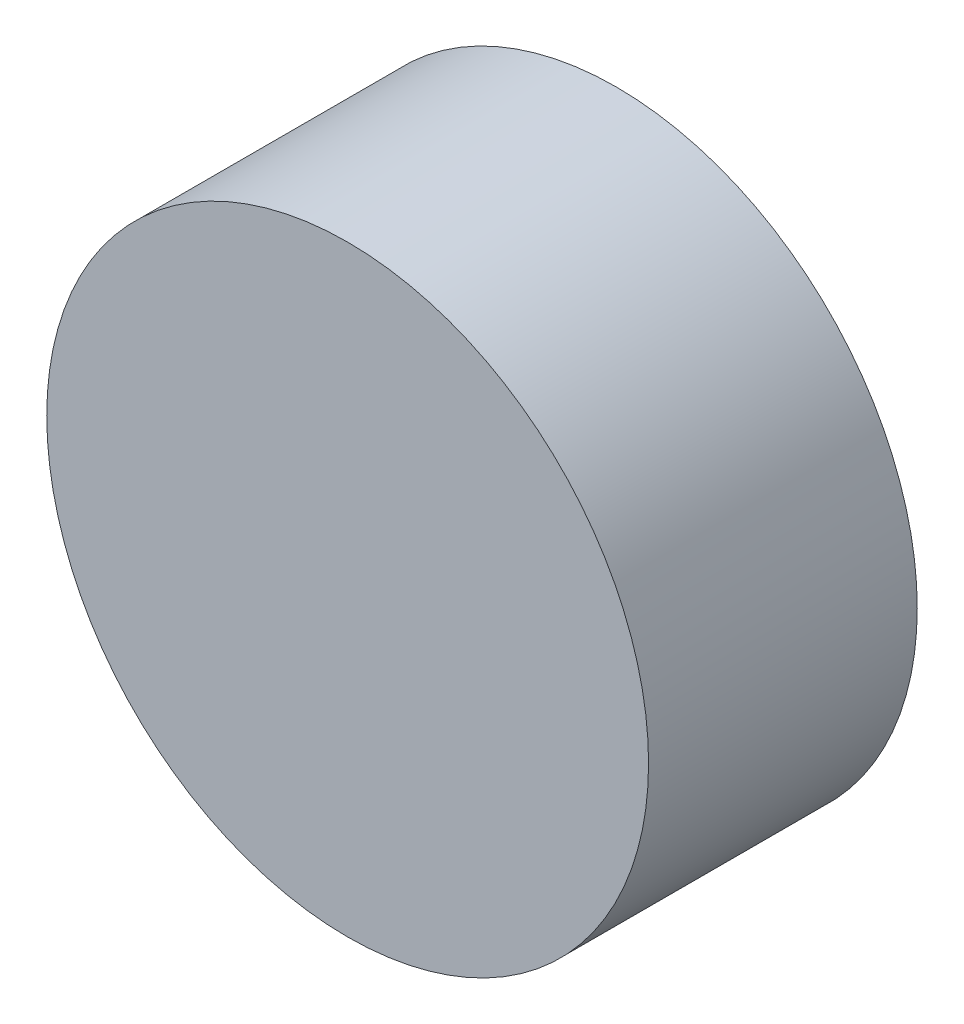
from build123d import *

# Parameters (mm, degrees)
SKETCH1_R           = 28.000000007
BOSS_EXTRUDE1_DEPTH = 12.5


with BuildPart() as part:
    # Sketch1 → Boss-Extrude1 (new, symmetric)
    with BuildSketch(Plane.XY):
        Circle(SKETCH1_R)
    extrude(amount=BOSS_EXTRUDE1_DEPTH, both=True)


solid = part.part
